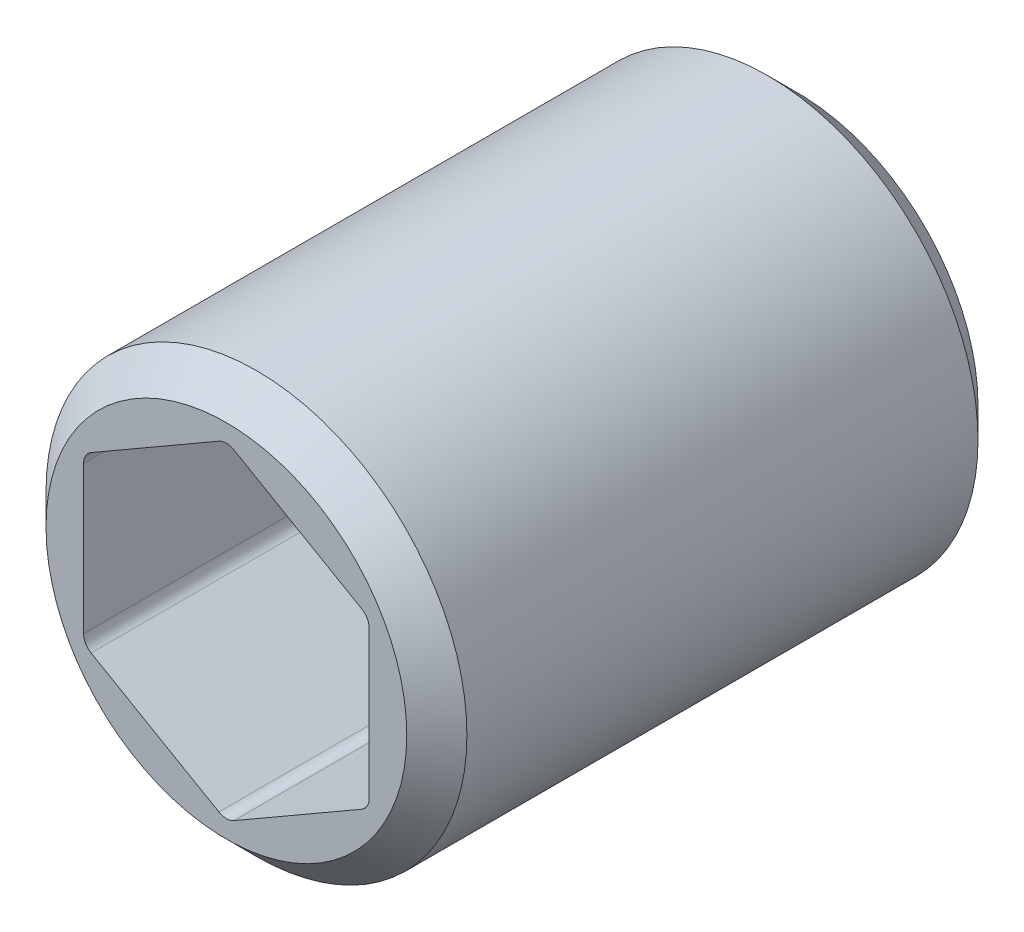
ISO-10303-21;
HEADER;
FILE_DESCRIPTION(('STEP AP214'),'2;1');
FILE_NAME('part.step','',(''),(''),'','','');
FILE_SCHEMA(('AUTOMOTIVE_DESIGN { 1 0 10303 214 1 1 1 1 }'));
ENDSEC;
DATA;
#1=APPLICATION_CONTEXT('core data for automotive mechanical design processes');
#2=APPLICATION_PROTOCOL_DEFINITION('international standard','automotive_design',2000,#1);
#3=PRODUCT_CONTEXT('',#1,'mechanical');
#4=PRODUCT('Part','Part','',(#3));
#5=PRODUCT_RELATED_PRODUCT_CATEGORY('part','',(#4));
#6=PRODUCT_DEFINITION_FORMATION('','',#4);
#7=PRODUCT_DEFINITION_CONTEXT('part definition',#1,'design');
#8=PRODUCT_DEFINITION('design','',#6,#7);
#9=PRODUCT_DEFINITION_SHAPE('','',#8);
#10=(LENGTH_UNIT() NAMED_UNIT(*) SI_UNIT(.MILLI.,.METRE.));
#11=(NAMED_UNIT(*) PLANE_ANGLE_UNIT() SI_UNIT($,.RADIAN.));
#12=(NAMED_UNIT(*) SI_UNIT($,.STERADIAN.) SOLID_ANGLE_UNIT());
#13=UNCERTAINTY_MEASURE_WITH_UNIT(LENGTH_MEASURE(1.E-05),#10,'distance_accuracy_value','');
#14=(GEOMETRIC_REPRESENTATION_CONTEXT(3) GLOBAL_UNCERTAINTY_ASSIGNED_CONTEXT((#13)) GLOBAL_UNIT_ASSIGNED_CONTEXT((#10,
#11,#12)) REPRESENTATION_CONTEXT('',''));
#15=CARTESIAN_POINT('',(0.,0.,0.));
#16=DIRECTION('',(0.,0.,1.));
#17=DIRECTION('',(1.,0.,0.));
#18=AXIS2_PLACEMENT_3D('',#15,#16,#17);
#19=CARTESIAN_POINT('',(0.,0.,38.));
#20=DIRECTION('',(0.,0.,-1.));
#21=DIRECTION('',(-1.,0.,0.));
#22=AXIS2_PLACEMENT_3D('',#19,#20,#21);
#23=CYLINDRICAL_SURFACE('',#22,14.);
#24=CARTESIAN_POINT('',(-13.9998000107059,-0.074830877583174,7.38287925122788));
#25=CARTESIAN_POINT('',(-13.9990234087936,-0.219629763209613,7.38288483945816));
#26=CARTESIAN_POINT('',(-13.9959819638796,-0.36448969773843,7.39501638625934));
#27=CARTESIAN_POINT('',(-13.9856298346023,-0.650104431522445,7.4431801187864));
#28=CARTESIAN_POINT('',(-13.9783154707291,-0.79085558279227,7.47923290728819));
#29=CARTESIAN_POINT('',(-13.96017423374,-1.06408189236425,7.57408885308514));
#30=CARTESIAN_POINT('',(-13.9493506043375,-1.19656455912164,7.6328710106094));
#31=CARTESIAN_POINT('',(-13.9253141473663,-1.44976591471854,7.77145730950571));
#32=CARTESIAN_POINT('',(-13.9121015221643,-1.57048559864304,7.851259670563));
#33=CARTESIAN_POINT('',(-13.8845143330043,-1.79821577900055,8.03065427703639));
#34=CARTESIAN_POINT('',(-13.8701286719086,-1.90506246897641,8.13045278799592));
#35=CARTESIAN_POINT('',(-13.8418674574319,-2.1005923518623,8.34656418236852));
#36=CARTESIAN_POINT('',(-13.827991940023,-2.18927426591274,8.46287822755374));
#37=CARTESIAN_POINT('',(-13.8021733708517,-2.34657908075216,8.70979516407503));
#38=CARTESIAN_POINT('',(-13.7902453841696,-2.41504863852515,8.8404974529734));
#39=CARTESIAN_POINT('',(-13.7698068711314,-2.52899016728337,9.11181904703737));
#40=CARTESIAN_POINT('',(-13.7612960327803,-2.574464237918,9.25243744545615));
#41=CARTESIAN_POINT('',(-13.7487630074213,-2.64057665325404,9.53776267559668));
#42=CARTESIAN_POINT('',(-13.7446868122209,-2.66151407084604,9.6823977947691));
#43=CARTESIAN_POINT('',(-13.7413114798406,-2.6788883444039,9.97318108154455));
#44=CARTESIAN_POINT('',(-13.7420119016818,-2.67532746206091,10.1193291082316));
#45=CARTESIAN_POINT('',(-13.7480646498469,-2.64404200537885,10.4068987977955));
#46=CARTESIAN_POINT('',(-13.7533538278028,-2.61664543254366,10.5483576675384));
#47=CARTESIAN_POINT('',(-13.7679016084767,-2.53898248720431,10.8246331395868));
#48=CARTESIAN_POINT('',(-13.777160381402,-2.48871513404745,10.9594494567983));
#49=CARTESIAN_POINT('',(-13.7986931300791,-2.36641648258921,11.2195768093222));
#50=CARTESIAN_POINT('',(-13.8109854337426,-2.2942522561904,11.3448237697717));
#51=CARTESIAN_POINT('',(-13.8372203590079,-2.13030607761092,11.5815527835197));
#52=CARTESIAN_POINT('',(-13.8511631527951,-2.03852207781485,11.6930333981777));
#53=CARTESIAN_POINT('',(-13.8794491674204,-1.8361575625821,11.9009818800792));
#54=CARTESIAN_POINT('',(-13.8937952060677,-1.72529370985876,11.9971738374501));
#55=CARTESIAN_POINT('',(-13.9211138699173,-1.48886762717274,12.1696371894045));
#56=CARTESIAN_POINT('',(-13.9340864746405,-1.36330517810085,12.2459082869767));
#57=CARTESIAN_POINT('',(-13.9572886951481,-1.10067353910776,12.3764516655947));
#58=CARTESIAN_POINT('',(-13.9675130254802,-0.96358283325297,12.4306816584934));
#59=CARTESIAN_POINT('',(-13.9840889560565,-0.682001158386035,12.5152592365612));
#60=CARTESIAN_POINT('',(-13.9904409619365,-0.537510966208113,12.5456093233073));
#61=CARTESIAN_POINT('',(-13.9985527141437,-0.247497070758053,12.5811897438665));
#62=CARTESIAN_POINT('',(-14.0003783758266,-0.102019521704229,12.5867815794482));
#63=CARTESIAN_POINT('',(-13.9994901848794,0.187813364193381,12.5736434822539));
#64=CARTESIAN_POINT('',(-13.9967765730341,0.332168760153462,12.5549148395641));
#65=CARTESIAN_POINT('',(-13.9872190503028,0.614398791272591,12.4939807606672));
#66=CARTESIAN_POINT('',(-13.9804103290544,0.752317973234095,12.4519755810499));
#67=CARTESIAN_POINT('',(-13.9634950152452,1.01916561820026,12.3458839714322));
#68=CARTESIAN_POINT('',(-13.9533882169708,1.14809351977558,12.2817961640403));
#69=CARTESIAN_POINT('',(-13.9309100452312,1.39472230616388,12.1326212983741));
#70=CARTESIAN_POINT('',(-13.9185170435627,1.51229807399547,12.0473307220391));
#71=CARTESIAN_POINT('',(-13.8929396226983,1.73160052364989,11.8584465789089));
#72=CARTESIAN_POINT('',(-13.8797551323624,1.83332577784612,11.7548513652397));
#73=CARTESIAN_POINT('',(-13.8539171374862,2.01939072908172,11.5306920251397));
#74=CARTESIAN_POINT('',(-13.8412727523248,2.10348748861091,11.4099250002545));
#75=CARTESIAN_POINT('',(-13.8181801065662,2.25020836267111,11.1557893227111));
#76=CARTESIAN_POINT('',(-13.8077317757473,2.3128331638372,11.0224210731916));
#77=CARTESIAN_POINT('',(-13.790311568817,2.41453433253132,10.747384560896));
#78=CARTESIAN_POINT('',(-13.7833257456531,2.45370530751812,10.6057522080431));
#79=CARTESIAN_POINT('',(-13.7736113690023,2.50766717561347,10.3177792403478));
#80=CARTESIAN_POINT('',(-13.7708823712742,2.52246061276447,10.1714391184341));
#81=CARTESIAN_POINT('',(-13.7700198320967,2.52716372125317,9.88050951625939));
#82=CARTESIAN_POINT('',(-13.7718192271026,2.51743652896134,9.73592598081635));
#83=CARTESIAN_POINT('',(-13.7796576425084,2.47416865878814,9.45049034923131));
#84=CARTESIAN_POINT('',(-13.7856966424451,2.44062809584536,9.30963823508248));
#85=CARTESIAN_POINT('',(-13.8012904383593,2.35083763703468,9.03585510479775));
#86=CARTESIAN_POINT('',(-13.8108392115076,2.29462662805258,8.90291096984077));
#87=CARTESIAN_POINT('',(-13.8323560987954,2.16112842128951,8.64828006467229));
#88=CARTESIAN_POINT('',(-13.8443243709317,2.08383984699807,8.5265940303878));
#89=CARTESIAN_POINT('',(-13.8695059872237,1.90910490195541,8.2961061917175));
#90=CARTESIAN_POINT('',(-13.8827343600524,1.8113925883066,8.18750760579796));
#91=CARTESIAN_POINT('',(-13.9087804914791,1.59913555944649,7.9881258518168));
#92=CARTESIAN_POINT('',(-13.9215981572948,1.48458707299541,7.89734668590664));
#93=CARTESIAN_POINT('',(-13.9454461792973,1.24081943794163,7.73551626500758));
#94=CARTESIAN_POINT('',(-13.95646157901,1.11149130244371,7.66462691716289));
#95=CARTESIAN_POINT('',(-13.9752681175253,0.84260089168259,7.54569055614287));
#96=CARTESIAN_POINT('',(-13.9830623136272,0.703048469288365,7.4976218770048));
#97=CARTESIAN_POINT('',(-13.9929338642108,0.456745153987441,7.43555064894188));
#98=CARTESIAN_POINT('',(-13.995990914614,0.351436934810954,7.41583113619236));
#99=CARTESIAN_POINT('',(-13.9997109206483,0.139153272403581,7.38949352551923));
#100=CARTESIAN_POINT('',(-14.0003739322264,0.0321778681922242,7.38287512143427));
#101=CARTESIAN_POINT('',(-13.9998000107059,-0.074830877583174,7.38287925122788));
#102=B_SPLINE_CURVE_WITH_KNOTS('',3,(#24,#25,#26,#27,#28,#29,#30,#31,#32,#33,#34,#35,#36,#37,
#38,#39,#40,#41,#42,#43,#44,#45,#46,#47,#48,#49,#50,#51,#52,#53,#54,#55,#56,#57,#58,#59,#60,#61,
#62,#63,#64,#65,#66,#67,#68,#69,#70,#71,#72,#73,#74,#75,#76,#77,#78,#79,#80,#81,#82,#83,#84,#85,
#86,#87,#88,#89,#90,#91,#92,#93,#94,#95,#96,#97,#98,#99,#100,#101),.UNSPECIFIED.,.T.,.F.,(4,2,2,
2,2,2,2,2,2,2,2,2,2,2,2,2,2,2,2,2,2,2,2,2,2,2,2,2,2,2,2,2,2,2,2,2,2,2,4),(0.,0.434011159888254,
0.868396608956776,1.30238168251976,1.73633001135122,2.17500926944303,2.61371940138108,
3.05567701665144,3.49759427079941,3.93406712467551,4.37049968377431,4.80101984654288,
5.23155847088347,5.66476488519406,6.09801653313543,6.53836693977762,6.97872391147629,
7.41992181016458,7.86107348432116,8.29576208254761,8.73042762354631,9.16141036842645,
9.59242000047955,10.0277382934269,10.4630957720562,10.9041071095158,11.3451043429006,
11.7843104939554,12.223470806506,12.6561657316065,13.0888585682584,13.5208123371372,
13.9527943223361,14.3907972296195,14.8288983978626,15.2704686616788,15.7116188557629,
16.0323677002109,16.353109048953),.UNSPECIFIED.);
#103=CARTESIAN_POINT('',(-13.9998000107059,-0.074830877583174,7.38287925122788));
#104=VERTEX_POINT('',#103);
#105=EDGE_CURVE('E749',#104,#104,#102,.T.);
#106=ORIENTED_EDGE('',*,*,#105,.F.);
#107=EDGE_LOOP('',(#106));
#108=FACE_BOUND('',#107,.T.);
#109=CARTESIAN_POINT('',(0.,0.,36.));
#110=DIRECTION('',(0.,0.,1.));
#111=DIRECTION('',(1.,0.,0.));
#112=AXIS2_PLACEMENT_3D('',#109,#110,#111);
#113=CIRCLE('',#112,14.);
#114=CARTESIAN_POINT('',(14.,0.,36.));
#115=VERTEX_POINT('',#114);
#116=EDGE_CURVE('E365',#115,#115,#113,.F.);
#117=ORIENTED_EDGE('',*,*,#116,.T.);
#118=EDGE_LOOP('',(#117));
#119=FACE_BOUND('',#118,.T.);
#120=CARTESIAN_POINT('',(0.,0.,2.00000000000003));
#121=DIRECTION('',(0.,0.,1.));
#122=DIRECTION('',(1.,0.,0.));
#123=AXIS2_PLACEMENT_3D('',#120,#121,#122);
#124=CIRCLE('',#123,14.);
#125=CARTESIAN_POINT('',(14.,0.,2.00000000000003));
#126=VERTEX_POINT('',#125);
#127=EDGE_CURVE('E628',#126,#126,#124,.T.);
#128=ORIENTED_EDGE('',*,*,#127,.T.);
#129=EDGE_LOOP('',(#128));
#130=FACE_BOUND('',#129,.T.);
#131=ADVANCED_FACE('F358',(#108,#119,#130),#23,.T.);
#132=CARTESIAN_POINT('',(0.,0.,38.));
#133=DIRECTION('',(0.,0.,1.));
#134=DIRECTION('',(1.,0.,0.));
#135=AXIS2_PLACEMENT_3D('',#132,#133,#134);
#136=PLANE('',#135);
#137=CARTESIAN_POINT('',(0.,0.,38.));
#138=DIRECTION('',(0.,0.,1.));
#139=DIRECTION('',(1.,0.,0.));
#140=AXIS2_PLACEMENT_3D('',#137,#138,#139);
#141=CIRCLE('',#140,12.);
#142=CARTESIAN_POINT('',(12.,0.,38.));
#143=VERTEX_POINT('',#142);
#144=EDGE_CURVE('E625',#143,#143,#141,.T.);
#145=ORIENTED_EDGE('',*,*,#144,.T.);
#146=EDGE_LOOP('',(#145));
#147=FACE_BOUND('',#146,.T.);
#148=DIRECTION('',(0.866025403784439,-0.5,0.));
#149=VECTOR('',#148,1.);
#150=CARTESIAN_POINT('',(-9.50000000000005,-5.48482755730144,38.));
#151=LINE('',#150,#149);
#152=CARTESIAN_POINT('',(-9.00000000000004,-5.77350269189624,38.));
#153=VERTEX_POINT('',#152);
#154=CARTESIAN_POINT('',(-0.499999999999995,-10.6809799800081,38.));
#155=VERTEX_POINT('',#154);
#156=EDGE_CURVE('E785',#153,#155,#151,.T.);
#157=ORIENTED_EDGE('',*,*,#156,.F.);
#158=CARTESIAN_POINT('',(-8.50000000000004,-4.9074772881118,38.));
#159=DIRECTION('',(0.,0.,1.));
#160=DIRECTION('',(1.,0.,0.));
#161=AXIS2_PLACEMENT_3D('',#158,#159,#160);
#162=CIRCLE('',#161,1.);
#163=CARTESIAN_POINT('',(-9.50000000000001,-4.90747728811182,38.));
#164=VERTEX_POINT('',#163);
#165=EDGE_CURVE('E613',#153,#164,#162,.F.);
#166=ORIENTED_EDGE('',*,*,#165,.T.);
#167=DIRECTION('',(0.,-1.,0.));
#168=VECTOR('',#167,1.);
#169=CARTESIAN_POINT('',(-9.50000000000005,5.48482755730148,38.));
#170=LINE('',#169,#168);
#171=CARTESIAN_POINT('',(-9.50000000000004,4.90747728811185,38.));
#172=VERTEX_POINT('',#171);
#173=EDGE_CURVE('E524',#172,#164,#170,.T.);
#174=ORIENTED_EDGE('',*,*,#173,.F.);
#175=CARTESIAN_POINT('',(-8.5,4.90747728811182,38.));
#176=DIRECTION('',(0.,0.,1.));
#177=DIRECTION('',(1.,0.,0.));
#178=AXIS2_PLACEMENT_3D('',#175,#176,#177);
#179=CIRCLE('',#178,1.);
#180=CARTESIAN_POINT('',(-9.00000000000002,5.77350269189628,38.));
#181=VERTEX_POINT('',#180);
#182=EDGE_CURVE('E523',#172,#181,#179,.F.);
#183=ORIENTED_EDGE('',*,*,#182,.T.);
#184=DIRECTION('',(-0.866025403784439,-0.5,0.));
#185=VECTOR('',#184,1.);
#186=CARTESIAN_POINT('',(0.,10.9696551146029,38.));
#187=LINE('',#186,#185);
#188=CARTESIAN_POINT('',(-0.499999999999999,10.6809799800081,38.));
#189=VERTEX_POINT('',#188);
#190=EDGE_CURVE('E513',#189,#181,#187,.T.);
#191=ORIENTED_EDGE('',*,*,#190,.F.);
#192=CARTESIAN_POINT('',(0.,9.81495457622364,38.));
#193=DIRECTION('',(0.,0.,1.));
#194=DIRECTION('',(1.,0.,0.));
#195=AXIS2_PLACEMENT_3D('',#192,#193,#194);
#196=CIRCLE('',#195,1.);
#197=CARTESIAN_POINT('',(0.500000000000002,10.6809799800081,38.));
#198=VERTEX_POINT('',#197);
#199=EDGE_CURVE('E496',#189,#198,#196,.F.);
#200=ORIENTED_EDGE('',*,*,#199,.T.);
#201=DIRECTION('',(-0.866025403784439,0.5,0.));
#202=VECTOR('',#201,1.);
#203=CARTESIAN_POINT('',(9.5,5.48482755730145,38.));
#204=LINE('',#203,#202);
#205=CARTESIAN_POINT('',(9.00000000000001,5.7735026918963,38.));
#206=VERTEX_POINT('',#205);
#207=EDGE_CURVE('E525',#206,#198,#204,.T.);
#208=ORIENTED_EDGE('',*,*,#207,.F.);
#209=CARTESIAN_POINT('',(8.50000000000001,4.90747728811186,38.));
#210=DIRECTION('',(0.,0.,1.));
#211=DIRECTION('',(1.,0.,0.));
#212=AXIS2_PLACEMENT_3D('',#209,#210,#211);
#213=CIRCLE('',#212,1.);
#214=CARTESIAN_POINT('',(9.50000000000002,4.90747728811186,38.));
#215=VERTEX_POINT('',#214);
#216=EDGE_CURVE('E506',#206,#215,#213,.F.);
#217=ORIENTED_EDGE('',*,*,#216,.T.);
#218=DIRECTION('',(0.,1.,0.));
#219=VECTOR('',#218,1.);
#220=CARTESIAN_POINT('',(9.49999999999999,-5.48482755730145,38.));
#221=LINE('',#220,#219);
#222=CARTESIAN_POINT('',(9.49999999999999,-4.90747728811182,38.));
#223=VERTEX_POINT('',#222);
#224=EDGE_CURVE('E530',#223,#215,#221,.T.);
#225=ORIENTED_EDGE('',*,*,#224,.F.);
#226=CARTESIAN_POINT('',(8.49999999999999,-4.90747728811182,38.));
#227=DIRECTION('',(0.,0.,1.));
#228=DIRECTION('',(1.,0.,0.));
#229=AXIS2_PLACEMENT_3D('',#226,#227,#228);
#230=CIRCLE('',#229,1.);
#231=CARTESIAN_POINT('',(9.,-5.77350269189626,38.));
#232=VERTEX_POINT('',#231);
#233=EDGE_CURVE('E617',#223,#232,#230,.F.);
#234=ORIENTED_EDGE('',*,*,#233,.T.);
#235=DIRECTION('',(0.86602540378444,0.500000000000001,0.));
#236=VECTOR('',#235,1.);
#237=CARTESIAN_POINT('',(0.,-10.969655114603,38.));
#238=LINE('',#237,#236);
#239=CARTESIAN_POINT('',(0.499999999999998,-10.6809799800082,38.));
#240=VERTEX_POINT('',#239);
#241=EDGE_CURVE('E788',#240,#232,#238,.T.);
#242=ORIENTED_EDGE('',*,*,#241,.F.);
#243=CARTESIAN_POINT('',(0.,-9.81495457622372,38.));
#244=DIRECTION('',(0.,0.,1.));
#245=DIRECTION('',(1.,0.,0.));
#246=AXIS2_PLACEMENT_3D('',#243,#244,#245);
#247=CIRCLE('',#246,1.);
#248=EDGE_CURVE('E615',#240,#155,#247,.F.);
#249=ORIENTED_EDGE('',*,*,#248,.T.);
#250=EDGE_LOOP('',(#157,#166,#174,#183,#191,#200,#208,#217,#225,#234,#242,#249));
#251=FACE_BOUND('',#250,.T.);
#252=ADVANCED_FACE('F521',(#147,#251),#136,.T.);
#253=CARTESIAN_POINT('',(0.,0.,0.));
#254=DIRECTION('',(0.,0.,1.));
#255=DIRECTION('',(1.,0.,0.));
#256=AXIS2_PLACEMENT_3D('',#253,#254,#255);
#257=PLANE('',#256);
#258=CARTESIAN_POINT('',(0.,0.,0.));
#259=DIRECTION('',(0.,0.,1.));
#260=DIRECTION('',(1.,0.,0.));
#261=AXIS2_PLACEMENT_3D('',#258,#259,#260);
#262=CIRCLE('',#261,12.);
#263=CARTESIAN_POINT('',(12.,0.,0.));
#264=VERTEX_POINT('',#263);
#265=EDGE_CURVE('E13',#264,#264,#262,.F.);
#266=ORIENTED_EDGE('',*,*,#265,.T.);
#267=EDGE_LOOP('',(#266));
#268=FACE_BOUND('',#267,.T.);
#269=DIRECTION('',(1.,0.,0.));
#270=VECTOR('',#269,1.);
#271=CARTESIAN_POINT('',(6.50000000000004,6.50000000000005,0.));
#272=LINE('',#271,#270);
#273=CARTESIAN_POINT('',(-5.5,6.5,0.));
#274=VERTEX_POINT('',#273);
#275=CARTESIAN_POINT('',(5.50000000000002,6.50000000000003,0.));
#276=VERTEX_POINT('',#275);
#277=EDGE_CURVE('E764',#274,#276,#272,.T.);
#278=ORIENTED_EDGE('',*,*,#277,.F.);
#279=CARTESIAN_POINT('',(-5.50000000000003,5.50000000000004,0.));
#280=DIRECTION('',(0.,0.,1.));
#281=DIRECTION('',(1.,0.,0.));
#282=AXIS2_PLACEMENT_3D('',#279,#280,#281);
#283=CIRCLE('',#282,1.);
#284=CARTESIAN_POINT('',(-6.5,5.5,0.));
#285=VERTEX_POINT('',#284);
#286=EDGE_CURVE('E372',#274,#285,#283,.T.);
#287=ORIENTED_EDGE('',*,*,#286,.T.);
#288=DIRECTION('',(0.,1.,0.));
#289=VECTOR('',#288,1.);
#290=CARTESIAN_POINT('',(-6.5,6.5,0.));
#291=LINE('',#290,#289);
#292=CARTESIAN_POINT('',(-6.5,-5.5,0.));
#293=VERTEX_POINT('',#292);
#294=EDGE_CURVE('E762',#293,#285,#291,.T.);
#295=ORIENTED_EDGE('',*,*,#294,.F.);
#296=CARTESIAN_POINT('',(-5.5,-5.5,0.));
#297=DIRECTION('',(0.,0.,1.));
#298=DIRECTION('',(1.,0.,0.));
#299=AXIS2_PLACEMENT_3D('',#296,#297,#298);
#300=CIRCLE('',#299,1.);
#301=CARTESIAN_POINT('',(-5.5,-6.5,0.));
#302=VERTEX_POINT('',#301);
#303=EDGE_CURVE('E380',#293,#302,#300,.T.);
#304=ORIENTED_EDGE('',*,*,#303,.T.);
#305=DIRECTION('',(-1.,0.,0.));
#306=VECTOR('',#305,1.);
#307=CARTESIAN_POINT('',(6.5,-6.5,0.));
#308=LINE('',#307,#306);
#309=CARTESIAN_POINT('',(5.5,-6.5,0.));
#310=VERTEX_POINT('',#309);
#311=EDGE_CURVE('E770',#310,#302,#308,.T.);
#312=ORIENTED_EDGE('',*,*,#311,.F.);
#313=CARTESIAN_POINT('',(5.5,-5.5,0.));
#314=DIRECTION('',(0.,0.,1.));
#315=DIRECTION('',(1.,0.,0.));
#316=AXIS2_PLACEMENT_3D('',#313,#314,#315);
#317=CIRCLE('',#316,1.);
#318=CARTESIAN_POINT('',(6.5,-5.5,0.));
#319=VERTEX_POINT('',#318);
#320=EDGE_CURVE('E619',#310,#319,#317,.T.);
#321=ORIENTED_EDGE('',*,*,#320,.T.);
#322=DIRECTION('',(0.,-1.,0.));
#323=VECTOR('',#322,1.);
#324=CARTESIAN_POINT('',(6.50000000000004,6.50000000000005,0.));
#325=LINE('',#324,#323);
#326=CARTESIAN_POINT('',(6.50000000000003,5.50000000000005,0.));
#327=VERTEX_POINT('',#326);
#328=EDGE_CURVE('E767',#327,#319,#325,.T.);
#329=ORIENTED_EDGE('',*,*,#328,.F.);
#330=CARTESIAN_POINT('',(5.5,5.5,0.));
#331=DIRECTION('',(0.,0.,1.));
#332=DIRECTION('',(1.,0.,0.));
#333=AXIS2_PLACEMENT_3D('',#330,#331,#332);
#334=CIRCLE('',#333,1.);
#335=EDGE_CURVE('E621',#327,#276,#334,.T.);
#336=ORIENTED_EDGE('',*,*,#335,.T.);
#337=EDGE_LOOP('',(#278,#287,#295,#304,#312,#321,#329,#336));
#338=FACE_BOUND('',#337,.T.);
#339=ADVANCED_FACE('F644',(#268,#338),#257,.F.);
#340=CARTESIAN_POINT('',(-9.50000000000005,-5.48482755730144,24.));
#341=DIRECTION('',(-0.5,-0.866025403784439,0.));
#342=DIRECTION('',(0.866025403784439,-0.5,0.));
#343=AXIS2_PLACEMENT_3D('',#340,#341,#342);
#344=PLANE('',#343);
#345=DIRECTION('',(0.866025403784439,-0.5,0.));
#346=VECTOR('',#345,1.);
#347=CARTESIAN_POINT('',(-9.50000000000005,-5.48482755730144,24.));
#348=LINE('',#347,#346);
#349=CARTESIAN_POINT('',(-9.00000000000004,-5.77350269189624,24.));
#350=VERTEX_POINT('',#349);
#351=CARTESIAN_POINT('',(-0.499999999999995,-10.6809799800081,24.));
#352=VERTEX_POINT('',#351);
#353=EDGE_CURVE('E528',#350,#352,#348,.T.);
#354=ORIENTED_EDGE('',*,*,#353,.F.);
#355=DIRECTION('',(0.,0.,1.));
#356=VECTOR('',#355,1.);
#357=CARTESIAN_POINT('',(-9.00000000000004,-5.77350269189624,38.));
#358=LINE('',#357,#356);
#359=EDGE_CURVE('E577',#350,#153,#358,.T.);
#360=ORIENTED_EDGE('',*,*,#359,.T.);
#361=ORIENTED_EDGE('',*,*,#156,.T.);
#362=DIRECTION('',(0.,0.,1.));
#363=VECTOR('',#362,1.);
#364=CARTESIAN_POINT('',(-0.499999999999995,-10.6809799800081,24.));
#365=LINE('',#364,#363);
#366=EDGE_CURVE('E575',#155,#352,#365,.F.);
#367=ORIENTED_EDGE('',*,*,#366,.T.);
#368=EDGE_LOOP('',(#354,#360,#361,#367));
#369=FACE_BOUND('',#368,.T.);
#370=ADVANCED_FACE('F649',(#369),#344,.F.);
#371=CARTESIAN_POINT('',(-9.50000000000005,5.48482755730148,24.));
#372=DIRECTION('',(-1.,0.,0.));
#373=DIRECTION('',(0.,-1.,0.));
#374=AXIS2_PLACEMENT_3D('',#371,#372,#373);
#375=PLANE('',#374);
#376=DIRECTION('',(0.,-1.,0.));
#377=VECTOR('',#376,1.);
#378=CARTESIAN_POINT('',(-9.50000000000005,5.48482755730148,24.));
#379=LINE('',#378,#377);
#380=CARTESIAN_POINT('',(-9.50000000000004,4.90747728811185,24.));
#381=VERTEX_POINT('',#380);
#382=CARTESIAN_POINT('',(-9.50000000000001,-4.90747728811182,24.));
#383=VERTEX_POINT('',#382);
#384=EDGE_CURVE('E546',#381,#383,#379,.T.);
#385=ORIENTED_EDGE('',*,*,#384,.F.);
#386=DIRECTION('',(0.,0.,1.));
#387=VECTOR('',#386,1.);
#388=CARTESIAN_POINT('',(-9.50000000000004,4.90747728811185,38.));
#389=LINE('',#388,#387);
#390=EDGE_CURVE('E572',#381,#172,#389,.T.);
#391=ORIENTED_EDGE('',*,*,#390,.T.);
#392=ORIENTED_EDGE('',*,*,#173,.T.);
#393=DIRECTION('',(0.,0.,1.));
#394=VECTOR('',#393,1.);
#395=CARTESIAN_POINT('',(-9.50000000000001,-4.90747728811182,24.));
#396=LINE('',#395,#394);
#397=EDGE_CURVE('E570',#164,#383,#396,.F.);
#398=ORIENTED_EDGE('',*,*,#397,.T.);
#399=EDGE_LOOP('',(#385,#391,#392,#398));
#400=FACE_BOUND('',#399,.T.);
#401=ADVANCED_FACE('F656',(#400),#375,.F.);
#402=CARTESIAN_POINT('',(0.,10.9696551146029,24.));
#403=DIRECTION('',(-0.5,0.866025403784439,0.));
#404=DIRECTION('',(-0.866025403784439,-0.5,0.));
#405=AXIS2_PLACEMENT_3D('',#402,#403,#404);
#406=PLANE('',#405);
#407=DIRECTION('',(-0.866025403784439,-0.5,0.));
#408=VECTOR('',#407,1.);
#409=CARTESIAN_POINT('',(0.,10.9696551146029,24.));
#410=LINE('',#409,#408);
#411=CARTESIAN_POINT('',(-0.499999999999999,10.6809799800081,24.));
#412=VERTEX_POINT('',#411);
#413=CARTESIAN_POINT('',(-9.00000000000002,5.77350269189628,24.));
#414=VERTEX_POINT('',#413);
#415=EDGE_CURVE('E516',#412,#414,#410,.T.);
#416=ORIENTED_EDGE('',*,*,#415,.F.);
#417=DIRECTION('',(0.,0.,1.));
#418=VECTOR('',#417,1.);
#419=CARTESIAN_POINT('',(-0.499999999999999,10.6809799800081,38.));
#420=LINE('',#419,#418);
#421=EDGE_CURVE('E500',#412,#189,#420,.T.);
#422=ORIENTED_EDGE('',*,*,#421,.T.);
#423=ORIENTED_EDGE('',*,*,#190,.T.);
#424=DIRECTION('',(0.,0.,1.));
#425=VECTOR('',#424,1.);
#426=CARTESIAN_POINT('',(-9.00000000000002,5.77350269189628,24.));
#427=LINE('',#426,#425);
#428=EDGE_CURVE('E518',#181,#414,#427,.F.);
#429=ORIENTED_EDGE('',*,*,#428,.T.);
#430=EDGE_LOOP('',(#416,#422,#423,#429));
#431=FACE_BOUND('',#430,.T.);
#432=ADVANCED_FACE('F512',(#431),#406,.F.);
#433=CARTESIAN_POINT('',(9.5,5.48482755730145,24.));
#434=DIRECTION('',(0.5,0.866025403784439,0.));
#435=DIRECTION('',(-0.866025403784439,0.5,0.));
#436=AXIS2_PLACEMENT_3D('',#433,#434,#435);
#437=PLANE('',#436);
#438=ORIENTED_EDGE('',*,*,#207,.T.);
#439=DIRECTION('',(0.,0.,1.));
#440=VECTOR('',#439,1.);
#441=CARTESIAN_POINT('',(0.500000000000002,10.6809799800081,24.));
#442=LINE('',#441,#440);
#443=CARTESIAN_POINT('',(0.500000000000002,10.6809799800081,24.));
#444=VERTEX_POINT('',#443);
#445=EDGE_CURVE('E501',#198,#444,#442,.F.);
#446=ORIENTED_EDGE('',*,*,#445,.T.);
#447=DIRECTION('',(-0.866025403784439,0.5,0.));
#448=VECTOR('',#447,1.);
#449=CARTESIAN_POINT('',(9.5,5.48482755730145,24.));
#450=LINE('',#449,#448);
#451=CARTESIAN_POINT('',(9.00000000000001,5.7735026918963,24.));
#452=VERTEX_POINT('',#451);
#453=EDGE_CURVE('E542',#452,#444,#450,.T.);
#454=ORIENTED_EDGE('',*,*,#453,.F.);
#455=DIRECTION('',(0.,0.,1.));
#456=VECTOR('',#455,1.);
#457=CARTESIAN_POINT('',(9.00000000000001,5.7735026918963,38.));
#458=LINE('',#457,#456);
#459=EDGE_CURVE('E517',#452,#206,#458,.T.);
#460=ORIENTED_EDGE('',*,*,#459,.T.);
#461=EDGE_LOOP('',(#438,#446,#454,#460));
#462=FACE_BOUND('',#461,.T.);
#463=ADVANCED_FACE('F666',(#462),#437,.F.);
#464=CARTESIAN_POINT('',(9.49999999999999,-5.48482755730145,24.));
#465=DIRECTION('',(1.,0.,0.));
#466=DIRECTION('',(0.,1.,0.));
#467=AXIS2_PLACEMENT_3D('',#464,#465,#466);
#468=PLANE('',#467);
#469=ORIENTED_EDGE('',*,*,#224,.T.);
#470=DIRECTION('',(0.,0.,1.));
#471=VECTOR('',#470,1.);
#472=CARTESIAN_POINT('',(9.50000000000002,4.90747728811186,24.));
#473=LINE('',#472,#471);
#474=CARTESIAN_POINT('',(9.50000000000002,4.90747728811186,24.));
#475=VERTEX_POINT('',#474);
#476=EDGE_CURVE('E568',#215,#475,#473,.F.);
#477=ORIENTED_EDGE('',*,*,#476,.T.);
#478=DIRECTION('',(0.,1.,0.));
#479=VECTOR('',#478,1.);
#480=CARTESIAN_POINT('',(9.49999999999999,-5.48482755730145,24.));
#481=LINE('',#480,#479);
#482=CARTESIAN_POINT('',(9.49999999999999,-4.90747728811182,24.));
#483=VERTEX_POINT('',#482);
#484=EDGE_CURVE('E539',#483,#475,#481,.T.);
#485=ORIENTED_EDGE('',*,*,#484,.F.);
#486=DIRECTION('',(0.,0.,1.));
#487=VECTOR('',#486,1.);
#488=CARTESIAN_POINT('',(9.49999999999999,-4.90747728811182,38.));
#489=LINE('',#488,#487);
#490=EDGE_CURVE('E565',#483,#223,#489,.T.);
#491=ORIENTED_EDGE('',*,*,#490,.T.);
#492=EDGE_LOOP('',(#469,#477,#485,#491));
#493=FACE_BOUND('',#492,.T.);
#494=ADVANCED_FACE('F662',(#493),#468,.F.);
#495=CARTESIAN_POINT('',(0.,-10.969655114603,24.));
#496=DIRECTION('',(0.500000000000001,-0.86602540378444,0.));
#497=DIRECTION('',(0.86602540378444,0.500000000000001,0.));
#498=AXIS2_PLACEMENT_3D('',#495,#496,#497);
#499=PLANE('',#498);
#500=DIRECTION('',(0.86602540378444,0.500000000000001,0.));
#501=VECTOR('',#500,1.);
#502=CARTESIAN_POINT('',(0.,-10.969655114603,24.));
#503=LINE('',#502,#501);
#504=CARTESIAN_POINT('',(0.499999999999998,-10.6809799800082,24.));
#505=VERTEX_POINT('',#504);
#506=CARTESIAN_POINT('',(9.,-5.77350269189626,24.));
#507=VERTEX_POINT('',#506);
#508=EDGE_CURVE('E536',#505,#507,#503,.T.);
#509=ORIENTED_EDGE('',*,*,#508,.F.);
#510=DIRECTION('',(0.,0.,1.));
#511=VECTOR('',#510,1.);
#512=CARTESIAN_POINT('',(0.499999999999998,-10.6809799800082,38.));
#513=LINE('',#512,#511);
#514=EDGE_CURVE('E582',#505,#240,#513,.T.);
#515=ORIENTED_EDGE('',*,*,#514,.T.);
#516=ORIENTED_EDGE('',*,*,#241,.T.);
#517=DIRECTION('',(0.,0.,1.));
#518=VECTOR('',#517,1.);
#519=CARTESIAN_POINT('',(9.,-5.77350269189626,24.));
#520=LINE('',#519,#518);
#521=EDGE_CURVE('E580',#232,#507,#520,.F.);
#522=ORIENTED_EDGE('',*,*,#521,.T.);
#523=EDGE_LOOP('',(#509,#515,#516,#522));
#524=FACE_BOUND('',#523,.T.);
#525=ADVANCED_FACE('F658',(#524),#499,.F.);
#526=CARTESIAN_POINT('',(9.49999999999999,-16.4544826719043,24.));
#527=DIRECTION('',(0.,0.,1.));
#528=DIRECTION('',(1.,0.,0.));
#529=AXIS2_PLACEMENT_3D('',#526,#527,#528);
#530=PLANE('',#529);
#531=CARTESIAN_POINT('',(0.,0.,24.));
#532=DIRECTION('',(0.,0.,1.));
#533=DIRECTION('',(1.,0.,0.));
#534=AXIS2_PLACEMENT_3D('',#531,#532,#533);
#535=CIRCLE('',#534,6.);
#536=CARTESIAN_POINT('',(6.,0.,24.));
#537=VERTEX_POINT('',#536);
#538=EDGE_CURVE('E759',#537,#537,#535,.T.);
#539=ORIENTED_EDGE('',*,*,#538,.F.);
#540=EDGE_LOOP('',(#539));
#541=FACE_BOUND('',#540,.T.);
#542=ORIENTED_EDGE('',*,*,#453,.T.);
#543=CARTESIAN_POINT('',(0.,9.81495457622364,24.));
#544=DIRECTION('',(0.,0.,1.));
#545=DIRECTION('',(1.,0.,0.));
#546=AXIS2_PLACEMENT_3D('',#543,#544,#545);
#547=CIRCLE('',#546,1.);
#548=EDGE_CURVE('E563',#444,#412,#547,.T.);
#549=ORIENTED_EDGE('',*,*,#548,.T.);
#550=ORIENTED_EDGE('',*,*,#415,.T.);
#551=CARTESIAN_POINT('',(-8.5,4.90747728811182,24.));
#552=DIRECTION('',(0.,0.,1.));
#553=DIRECTION('',(1.,0.,0.));
#554=AXIS2_PLACEMENT_3D('',#551,#552,#553);
#555=CIRCLE('',#554,1.);
#556=EDGE_CURVE('E559',#414,#381,#555,.T.);
#557=ORIENTED_EDGE('',*,*,#556,.T.);
#558=ORIENTED_EDGE('',*,*,#384,.T.);
#559=CARTESIAN_POINT('',(-8.50000000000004,-4.9074772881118,24.));
#560=DIRECTION('',(0.,0.,1.));
#561=DIRECTION('',(1.,0.,0.));
#562=AXIS2_PLACEMENT_3D('',#559,#560,#561);
#563=CIRCLE('',#562,1.);
#564=EDGE_CURVE('E557',#383,#350,#563,.T.);
#565=ORIENTED_EDGE('',*,*,#564,.T.);
#566=ORIENTED_EDGE('',*,*,#353,.T.);
#567=CARTESIAN_POINT('',(0.,-9.81495457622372,24.));
#568=DIRECTION('',(0.,0.,1.));
#569=DIRECTION('',(1.,0.,0.));
#570=AXIS2_PLACEMENT_3D('',#567,#568,#569);
#571=CIRCLE('',#570,1.);
#572=EDGE_CURVE('E555',#352,#505,#571,.T.);
#573=ORIENTED_EDGE('',*,*,#572,.T.);
#574=ORIENTED_EDGE('',*,*,#508,.T.);
#575=CARTESIAN_POINT('',(8.49999999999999,-4.90747728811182,24.));
#576=DIRECTION('',(0.,0.,1.));
#577=DIRECTION('',(1.,0.,0.));
#578=AXIS2_PLACEMENT_3D('',#575,#576,#577);
#579=CIRCLE('',#578,1.);
#580=EDGE_CURVE('E553',#507,#483,#579,.T.);
#581=ORIENTED_EDGE('',*,*,#580,.T.);
#582=ORIENTED_EDGE('',*,*,#484,.T.);
#583=CARTESIAN_POINT('',(8.50000000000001,4.90747728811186,24.));
#584=DIRECTION('',(0.,0.,1.));
#585=DIRECTION('',(1.,0.,0.));
#586=AXIS2_PLACEMENT_3D('',#583,#584,#585);
#587=CIRCLE('',#586,1.);
#588=EDGE_CURVE('E561',#475,#452,#587,.T.);
#589=ORIENTED_EDGE('',*,*,#588,.T.);
#590=EDGE_LOOP('',(#542,#549,#550,#557,#558,#565,#566,#573,#574,#581,#582,#589));
#591=FACE_BOUND('',#590,.T.);
#592=ADVANCED_FACE('F661',(#541,#591),#530,.T.);
#593=CARTESIAN_POINT('',(-6.5,6.5,19.));
#594=DIRECTION('',(-1.,0.,0.));
#595=DIRECTION('',(0.,0.,1.));
#596=AXIS2_PLACEMENT_3D('',#593,#594,#595);
#597=PLANE('',#596);
#598=CARTESIAN_POINT('',(-6.50000000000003,-0.074830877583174,9.98287925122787));
#599=DIRECTION('',(-1.,0.,0.));
#600=DIRECTION('',(0.,0.,1.));
#601=AXIS2_PLACEMENT_3D('',#598,#599,#600);
#602=CIRCLE('',#601,2.6);
#603=CARTESIAN_POINT('',(-6.50000000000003,-0.074830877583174,12.5828792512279));
#604=VERTEX_POINT('',#603);
#605=EDGE_CURVE('E756',#604,#604,#602,.F.);
#606=ORIENTED_EDGE('',*,*,#605,.F.);
#607=EDGE_LOOP('',(#606));
#608=FACE_BOUND('',#607,.T.);
#609=DIRECTION('',(0.,1.,0.));
#610=VECTOR('',#609,1.);
#611=CARTESIAN_POINT('',(-6.5,6.5,19.));
#612=LINE('',#611,#610);
#613=CARTESIAN_POINT('',(-6.5,-5.5,19.));
#614=VERTEX_POINT('',#613);
#615=CARTESIAN_POINT('',(-6.5,5.5,19.));
#616=VERTEX_POINT('',#615);
#617=EDGE_CURVE('E773',#614,#616,#612,.T.);
#618=ORIENTED_EDGE('',*,*,#617,.F.);
#619=DIRECTION('',(0.,0.,-1.));
#620=VECTOR('',#619,1.);
#621=CARTESIAN_POINT('',(-6.5,-5.5,0.));
#622=LINE('',#621,#620);
#623=EDGE_CURVE('E507',#614,#293,#622,.T.);
#624=ORIENTED_EDGE('',*,*,#623,.T.);
#625=ORIENTED_EDGE('',*,*,#294,.T.);
#626=DIRECTION('',(0.,0.,-1.));
#627=VECTOR('',#626,1.);
#628=CARTESIAN_POINT('',(-6.5,5.5,19.));
#629=LINE('',#628,#627);
#630=EDGE_CURVE('E608',#285,#616,#629,.F.);
#631=ORIENTED_EDGE('',*,*,#630,.T.);
#632=EDGE_LOOP('',(#618,#624,#625,#631));
#633=FACE_BOUND('',#632,.T.);
#634=ADVANCED_FACE('F678',(#608,#633),#597,.F.);
#635=CARTESIAN_POINT('',(6.5,-6.5,19.));
#636=DIRECTION('',(0.,-1.,0.));
#637=DIRECTION('',(0.,0.,-1.));
#638=AXIS2_PLACEMENT_3D('',#635,#636,#637);
#639=PLANE('',#638);
#640=DIRECTION('',(-1.,0.,0.));
#641=VECTOR('',#640,1.);
#642=CARTESIAN_POINT('',(6.5,-6.5,19.));
#643=LINE('',#642,#641);
#644=CARTESIAN_POINT('',(5.5,-6.5,19.));
#645=VERTEX_POINT('',#644);
#646=CARTESIAN_POINT('',(-5.5,-6.5,19.));
#647=VERTEX_POINT('',#646);
#648=EDGE_CURVE('E782',#645,#647,#643,.T.);
#649=ORIENTED_EDGE('',*,*,#648,.F.);
#650=DIRECTION('',(0.,0.,-1.));
#651=VECTOR('',#650,1.);
#652=CARTESIAN_POINT('',(5.5,-6.5,0.));
#653=LINE('',#652,#651);
#654=EDGE_CURVE('E587',#645,#310,#653,.T.);
#655=ORIENTED_EDGE('',*,*,#654,.T.);
#656=ORIENTED_EDGE('',*,*,#311,.T.);
#657=DIRECTION('',(0.,0.,-1.));
#658=VECTOR('',#657,1.);
#659=CARTESIAN_POINT('',(-5.5,-6.5,19.));
#660=LINE('',#659,#658);
#661=EDGE_CURVE('E585',#302,#647,#660,.F.);
#662=ORIENTED_EDGE('',*,*,#661,.T.);
#663=EDGE_LOOP('',(#649,#655,#656,#662));
#664=FACE_BOUND('',#663,.T.);
#665=ADVANCED_FACE('F682',(#664),#639,.F.);
#666=CARTESIAN_POINT('',(6.50000000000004,6.50000000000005,19.));
#667=DIRECTION('',(1.,0.,0.));
#668=DIRECTION('',(0.,0.,-1.));
#669=AXIS2_PLACEMENT_3D('',#666,#667,#668);
#670=PLANE('',#669);
#671=ORIENTED_EDGE('',*,*,#328,.T.);
#672=DIRECTION('',(0.,0.,-1.));
#673=VECTOR('',#672,1.);
#674=CARTESIAN_POINT('',(6.5,-5.5,19.));
#675=LINE('',#674,#673);
#676=CARTESIAN_POINT('',(6.5,-5.5,19.));
#677=VERTEX_POINT('',#676);
#678=EDGE_CURVE('E593',#319,#677,#675,.F.);
#679=ORIENTED_EDGE('',*,*,#678,.T.);
#680=DIRECTION('',(0.,-1.,0.));
#681=VECTOR('',#680,1.);
#682=CARTESIAN_POINT('',(6.50000000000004,6.50000000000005,19.));
#683=LINE('',#682,#681);
#684=CARTESIAN_POINT('',(6.50000000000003,5.50000000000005,19.));
#685=VERTEX_POINT('',#684);
#686=EDGE_CURVE('E779',#685,#677,#683,.T.);
#687=ORIENTED_EDGE('',*,*,#686,.F.);
#688=DIRECTION('',(0.,0.,-1.));
#689=VECTOR('',#688,1.);
#690=CARTESIAN_POINT('',(6.50000000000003,5.50000000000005,0.));
#691=LINE('',#690,#689);
#692=EDGE_CURVE('E590',#685,#327,#691,.T.);
#693=ORIENTED_EDGE('',*,*,#692,.T.);
#694=EDGE_LOOP('',(#671,#679,#687,#693));
#695=FACE_BOUND('',#694,.T.);
#696=ADVANCED_FACE('F688',(#695),#670,.F.);
#697=CARTESIAN_POINT('',(6.50000000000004,6.50000000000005,19.));
#698=DIRECTION('',(0.,1.,0.));
#699=DIRECTION('',(0.,0.,1.));
#700=AXIS2_PLACEMENT_3D('',#697,#698,#699);
#701=PLANE('',#700);
#702=ORIENTED_EDGE('',*,*,#277,.T.);
#703=DIRECTION('',(0.,0.,-1.));
#704=VECTOR('',#703,1.);
#705=CARTESIAN_POINT('',(5.50000000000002,6.50000000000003,19.));
#706=LINE('',#705,#704);
#707=CARTESIAN_POINT('',(5.50000000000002,6.50000000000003,19.));
#708=VERTEX_POINT('',#707);
#709=EDGE_CURVE('E606',#276,#708,#706,.F.);
#710=ORIENTED_EDGE('',*,*,#709,.T.);
#711=DIRECTION('',(1.,0.,0.));
#712=VECTOR('',#711,1.);
#713=CARTESIAN_POINT('',(6.50000000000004,6.50000000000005,19.));
#714=LINE('',#713,#712);
#715=CARTESIAN_POINT('',(-5.5,6.5,19.));
#716=VERTEX_POINT('',#715);
#717=EDGE_CURVE('E776',#716,#708,#714,.T.);
#718=ORIENTED_EDGE('',*,*,#717,.F.);
#719=DIRECTION('',(0.,0.,-1.));
#720=VECTOR('',#719,1.);
#721=CARTESIAN_POINT('',(-5.5,6.5,0.));
#722=LINE('',#721,#720);
#723=EDGE_CURVE('E603',#716,#274,#722,.T.);
#724=ORIENTED_EDGE('',*,*,#723,.T.);
#725=EDGE_LOOP('',(#702,#710,#718,#724));
#726=FACE_BOUND('',#725,.T.);
#727=ADVANCED_FACE('F684',(#726),#701,.F.);
#728=CARTESIAN_POINT('',(-6.5,-6.5,19.));
#729=DIRECTION('',(0.,0.,-1.));
#730=DIRECTION('',(-1.,0.,0.));
#731=AXIS2_PLACEMENT_3D('',#728,#729,#730);
#732=PLANE('',#731);
#733=CARTESIAN_POINT('',(0.,0.,19.));
#734=DIRECTION('',(0.,0.,-1.));
#735=DIRECTION('',(-1.,0.,0.));
#736=AXIS2_PLACEMENT_3D('',#733,#734,#735);
#737=CIRCLE('',#736,6.);
#738=CARTESIAN_POINT('',(-6.,0.,19.));
#739=VERTEX_POINT('',#738);
#740=EDGE_CURVE('E755',#739,#739,#737,.T.);
#741=ORIENTED_EDGE('',*,*,#740,.F.);
#742=EDGE_LOOP('',(#741));
#743=FACE_BOUND('',#742,.T.);
#744=ORIENTED_EDGE('',*,*,#686,.T.);
#745=CARTESIAN_POINT('',(5.5,-5.5,19.));
#746=DIRECTION('',(0.,0.,-1.));
#747=DIRECTION('',(-1.,0.,0.));
#748=AXIS2_PLACEMENT_3D('',#745,#746,#747);
#749=CIRCLE('',#748,1.);
#750=EDGE_CURVE('E601',#677,#645,#749,.T.);
#751=ORIENTED_EDGE('',*,*,#750,.T.);
#752=ORIENTED_EDGE('',*,*,#648,.T.);
#753=CARTESIAN_POINT('',(-5.5,-5.5,19.));
#754=DIRECTION('',(0.,0.,-1.));
#755=DIRECTION('',(-1.,0.,0.));
#756=AXIS2_PLACEMENT_3D('',#753,#754,#755);
#757=CIRCLE('',#756,1.);
#758=EDGE_CURVE('E597',#647,#614,#757,.T.);
#759=ORIENTED_EDGE('',*,*,#758,.T.);
#760=ORIENTED_EDGE('',*,*,#617,.T.);
#761=CARTESIAN_POINT('',(-5.50000000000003,5.50000000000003,19.));
#762=DIRECTION('',(0.,0.,-1.));
#763=DIRECTION('',(-1.,0.,0.));
#764=AXIS2_PLACEMENT_3D('',#761,#762,#763);
#765=CIRCLE('',#764,1.);
#766=EDGE_CURVE('E595',#616,#716,#765,.T.);
#767=ORIENTED_EDGE('',*,*,#766,.T.);
#768=ORIENTED_EDGE('',*,*,#717,.T.);
#769=CARTESIAN_POINT('',(5.5,5.5,19.));
#770=DIRECTION('',(0.,0.,-1.));
#771=DIRECTION('',(-1.,0.,0.));
#772=AXIS2_PLACEMENT_3D('',#769,#770,#771);
#773=CIRCLE('',#772,1.);
#774=EDGE_CURVE('E599',#708,#685,#773,.T.);
#775=ORIENTED_EDGE('',*,*,#774,.T.);
#776=EDGE_LOOP('',(#744,#751,#752,#759,#760,#767,#768,#775));
#777=FACE_BOUND('',#776,.T.);
#778=ADVANCED_FACE('F687',(#743,#777),#732,.T.);
#779=CARTESIAN_POINT('',(0.,0.,38.));
#780=DIRECTION('',(0.,0.,-1.));
#781=DIRECTION('',(-1.,0.,0.));
#782=AXIS2_PLACEMENT_3D('',#779,#780,#781);
#783=CYLINDRICAL_SURFACE('',#782,6.);
#784=ORIENTED_EDGE('',*,*,#538,.T.);
#785=EDGE_LOOP('',(#784));
#786=FACE_BOUND('',#785,.T.);
#787=ORIENTED_EDGE('',*,*,#740,.T.);
#788=EDGE_LOOP('',(#787));
#789=FACE_BOUND('',#788,.T.);
#790=ADVANCED_FACE('F698',(#786,#789),#783,.F.);
#791=CARTESIAN_POINT('',(0.,9.81495457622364,24.));
#792=DIRECTION('',(0.,0.,-1.));
#793=DIRECTION('',(-1.,0.,0.));
#794=AXIS2_PLACEMENT_3D('',#791,#792,#793);
#795=CYLINDRICAL_SURFACE('',#794,1.);
#796=ORIENTED_EDGE('',*,*,#548,.F.);
#797=ORIENTED_EDGE('',*,*,#445,.F.);
#798=ORIENTED_EDGE('',*,*,#199,.F.);
#799=ORIENTED_EDGE('',*,*,#421,.F.);
#800=EDGE_LOOP('',(#796,#797,#798,#799));
#801=FACE_BOUND('',#800,.T.);
#802=ADVANCED_FACE('F499',(#801),#795,.F.);
#803=CARTESIAN_POINT('',(8.50000000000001,4.90747728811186,24.));
#804=DIRECTION('',(0.,0.,-1.));
#805=DIRECTION('',(-1.,0.,0.));
#806=AXIS2_PLACEMENT_3D('',#803,#804,#805);
#807=CYLINDRICAL_SURFACE('',#806,1.);
#808=ORIENTED_EDGE('',*,*,#588,.F.);
#809=ORIENTED_EDGE('',*,*,#476,.F.);
#810=ORIENTED_EDGE('',*,*,#216,.F.);
#811=ORIENTED_EDGE('',*,*,#459,.F.);
#812=EDGE_LOOP('',(#808,#809,#810,#811));
#813=FACE_BOUND('',#812,.T.);
#814=ADVANCED_FACE('F705',(#813),#807,.F.);
#815=CARTESIAN_POINT('',(-8.5,4.90747728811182,24.));
#816=DIRECTION('',(0.,0.,-1.));
#817=DIRECTION('',(-1.,0.,0.));
#818=AXIS2_PLACEMENT_3D('',#815,#816,#817);
#819=CYLINDRICAL_SURFACE('',#818,1.);
#820=ORIENTED_EDGE('',*,*,#556,.F.);
#821=ORIENTED_EDGE('',*,*,#428,.F.);
#822=ORIENTED_EDGE('',*,*,#182,.F.);
#823=ORIENTED_EDGE('',*,*,#390,.F.);
#824=EDGE_LOOP('',(#820,#821,#822,#823));
#825=FACE_BOUND('',#824,.T.);
#826=ADVANCED_FACE('F708',(#825),#819,.F.);
#827=CARTESIAN_POINT('',(-8.50000000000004,-4.9074772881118,24.));
#828=DIRECTION('',(0.,0.,-1.));
#829=DIRECTION('',(-1.,0.,0.));
#830=AXIS2_PLACEMENT_3D('',#827,#828,#829);
#831=CYLINDRICAL_SURFACE('',#830,1.);
#832=ORIENTED_EDGE('',*,*,#564,.F.);
#833=ORIENTED_EDGE('',*,*,#397,.F.);
#834=ORIENTED_EDGE('',*,*,#165,.F.);
#835=ORIENTED_EDGE('',*,*,#359,.F.);
#836=EDGE_LOOP('',(#832,#833,#834,#835));
#837=FACE_BOUND('',#836,.T.);
#838=ADVANCED_FACE('F712',(#837),#831,.F.);
#839=CARTESIAN_POINT('',(0.,-9.81495457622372,24.));
#840=DIRECTION('',(0.,0.,-1.));
#841=DIRECTION('',(-1.,0.,0.));
#842=AXIS2_PLACEMENT_3D('',#839,#840,#841);
#843=CYLINDRICAL_SURFACE('',#842,1.);
#844=ORIENTED_EDGE('',*,*,#572,.F.);
#845=ORIENTED_EDGE('',*,*,#366,.F.);
#846=ORIENTED_EDGE('',*,*,#248,.F.);
#847=ORIENTED_EDGE('',*,*,#514,.F.);
#848=EDGE_LOOP('',(#844,#845,#846,#847));
#849=FACE_BOUND('',#848,.T.);
#850=ADVANCED_FACE('F716',(#849),#843,.F.);
#851=CARTESIAN_POINT('',(8.49999999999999,-4.90747728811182,24.));
#852=DIRECTION('',(0.,0.,-1.));
#853=DIRECTION('',(-1.,0.,0.));
#854=AXIS2_PLACEMENT_3D('',#851,#852,#853);
#855=CYLINDRICAL_SURFACE('',#854,1.);
#856=ORIENTED_EDGE('',*,*,#580,.F.);
#857=ORIENTED_EDGE('',*,*,#521,.F.);
#858=ORIENTED_EDGE('',*,*,#233,.F.);
#859=ORIENTED_EDGE('',*,*,#490,.F.);
#860=EDGE_LOOP('',(#856,#857,#858,#859));
#861=FACE_BOUND('',#860,.T.);
#862=ADVANCED_FACE('F720',(#861),#855,.F.);
#863=CARTESIAN_POINT('',(5.5,-5.5,19.));
#864=DIRECTION('',(0.,0.,1.));
#865=DIRECTION('',(1.,0.,0.));
#866=AXIS2_PLACEMENT_3D('',#863,#864,#865);
#867=CYLINDRICAL_SURFACE('',#866,1.);
#868=ORIENTED_EDGE('',*,*,#750,.F.);
#869=ORIENTED_EDGE('',*,*,#678,.F.);
#870=ORIENTED_EDGE('',*,*,#320,.F.);
#871=ORIENTED_EDGE('',*,*,#654,.F.);
#872=EDGE_LOOP('',(#868,#869,#870,#871));
#873=FACE_BOUND('',#872,.T.);
#874=ADVANCED_FACE('F724',(#873),#867,.F.);
#875=CARTESIAN_POINT('',(5.5,5.5,19.));
#876=DIRECTION('',(0.,0.,1.));
#877=DIRECTION('',(1.,0.,0.));
#878=AXIS2_PLACEMENT_3D('',#875,#876,#877);
#879=CYLINDRICAL_SURFACE('',#878,1.);
#880=ORIENTED_EDGE('',*,*,#774,.F.);
#881=ORIENTED_EDGE('',*,*,#709,.F.);
#882=ORIENTED_EDGE('',*,*,#335,.F.);
#883=ORIENTED_EDGE('',*,*,#692,.F.);
#884=EDGE_LOOP('',(#880,#881,#882,#883));
#885=FACE_BOUND('',#884,.T.);
#886=ADVANCED_FACE('F728',(#885),#879,.F.);
#887=CARTESIAN_POINT('',(-5.5,-5.5,19.));
#888=DIRECTION('',(0.,0.,1.));
#889=DIRECTION('',(1.,0.,0.));
#890=AXIS2_PLACEMENT_3D('',#887,#888,#889);
#891=CYLINDRICAL_SURFACE('',#890,1.);
#892=ORIENTED_EDGE('',*,*,#758,.F.);
#893=ORIENTED_EDGE('',*,*,#661,.F.);
#894=ORIENTED_EDGE('',*,*,#303,.F.);
#895=ORIENTED_EDGE('',*,*,#623,.F.);
#896=EDGE_LOOP('',(#892,#893,#894,#895));
#897=FACE_BOUND('',#896,.T.);
#898=ADVANCED_FACE('F732',(#897),#891,.F.);
#899=CARTESIAN_POINT('',(-5.50000000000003,5.50000000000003,19.));
#900=DIRECTION('',(0.,0.,1.));
#901=DIRECTION('',(1.,0.,0.));
#902=AXIS2_PLACEMENT_3D('',#899,#900,#901);
#903=CYLINDRICAL_SURFACE('',#902,1.);
#904=ORIENTED_EDGE('',*,*,#766,.F.);
#905=ORIENTED_EDGE('',*,*,#630,.F.);
#906=ORIENTED_EDGE('',*,*,#286,.F.);
#907=ORIENTED_EDGE('',*,*,#723,.F.);
#908=EDGE_LOOP('',(#904,#905,#906,#907));
#909=FACE_BOUND('',#908,.T.);
#910=ADVANCED_FACE('F639',(#909),#903,.F.);
#911=CARTESIAN_POINT('',(0.,0.,38.));
#912=DIRECTION('',(0.,0.,-1.));
#913=DIRECTION('',(-1.,0.,0.));
#914=AXIS2_PLACEMENT_3D('',#911,#912,#913);
#915=CONICAL_SURFACE('',#914,12.,0.785398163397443);
#916=ORIENTED_EDGE('',*,*,#116,.F.);
#917=EDGE_LOOP('',(#916));
#918=FACE_BOUND('',#917,.T.);
#919=ORIENTED_EDGE('',*,*,#144,.F.);
#920=EDGE_LOOP('',(#919));
#921=FACE_BOUND('',#920,.T.);
#922=ADVANCED_FACE('F635',(#918,#921),#915,.T.);
#923=CARTESIAN_POINT('',(0.,0.,2.00000000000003));
#924=DIRECTION('',(0.,0.,1.));
#925=DIRECTION('',(1.,0.,0.));
#926=AXIS2_PLACEMENT_3D('',#923,#924,#925);
#927=CONICAL_SURFACE('',#926,14.,0.785398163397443);
#928=ORIENTED_EDGE('',*,*,#265,.F.);
#929=EDGE_LOOP('',(#928));
#930=FACE_BOUND('',#929,.T.);
#931=ORIENTED_EDGE('',*,*,#127,.F.);
#932=EDGE_LOOP('',(#931));
#933=FACE_BOUND('',#932,.T.);
#934=ADVANCED_FACE('F638',(#930,#933),#927,.T.);
#935=CARTESIAN_POINT('',(-14.001,-0.074830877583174,9.98287925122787));
#936=DIRECTION('',(1.,0.,0.));
#937=DIRECTION('',(0.,0.,-1.));
#938=AXIS2_PLACEMENT_3D('',#935,#936,#937);
#939=CYLINDRICAL_SURFACE('',#938,2.6);
#940=ORIENTED_EDGE('',*,*,#605,.T.);
#941=EDGE_LOOP('',(#940));
#942=FACE_BOUND('',#941,.T.);
#943=ORIENTED_EDGE('',*,*,#105,.T.);
#944=EDGE_LOOP('',(#943));
#945=FACE_BOUND('',#944,.T.);
#946=ADVANCED_FACE('F741',(#942,#945),#939,.F.);
#947=CLOSED_SHELL('',(#131,#252,#339,#370,#401,#432,#463,#494,#525,#592,#634,#665,#696,#727,
#778,#790,#802,#814,#826,#838,#850,#862,#874,#886,#898,#910,#922,#934,#946));
#948=MANIFOLD_SOLID_BREP('B2',#947);
#949=ADVANCED_BREP_SHAPE_REPRESENTATION('',(#18,#948),#14);
#950=SHAPE_DEFINITION_REPRESENTATION(#9,#949);
ENDSEC;
END-ISO-10303-21;
